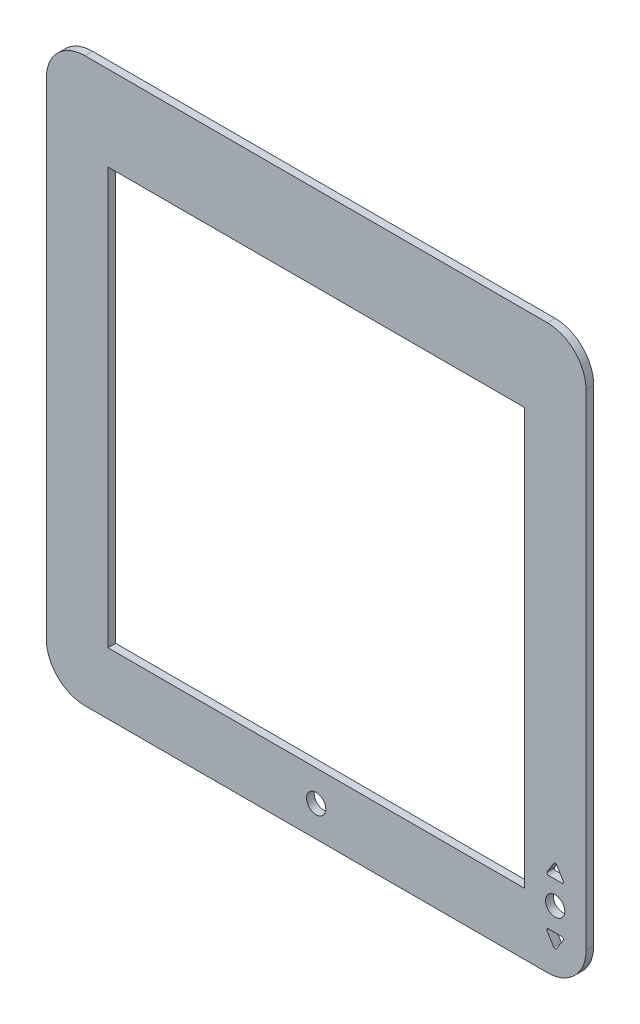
ISO-10303-21;
HEADER;
FILE_DESCRIPTION(('STEP AP214'),'2;1');
FILE_NAME('part.step','',(''),(''),'','','');
FILE_SCHEMA(('AUTOMOTIVE_DESIGN { 1 0 10303 214 1 1 1 1 }'));
ENDSEC;
DATA;
#1=APPLICATION_CONTEXT('core data for automotive mechanical design processes');
#2=APPLICATION_PROTOCOL_DEFINITION('international standard','automotive_design',2000,#1);
#3=PRODUCT_CONTEXT('',#1,'mechanical');
#4=PRODUCT('Part','Part','',(#3));
#5=PRODUCT_RELATED_PRODUCT_CATEGORY('part','',(#4));
#6=PRODUCT_DEFINITION_FORMATION('','',#4);
#7=PRODUCT_DEFINITION_CONTEXT('part definition',#1,'design');
#8=PRODUCT_DEFINITION('design','',#6,#7);
#9=PRODUCT_DEFINITION_SHAPE('','',#8);
#10=(LENGTH_UNIT() NAMED_UNIT(*) SI_UNIT(.MILLI.,.METRE.));
#11=(NAMED_UNIT(*) PLANE_ANGLE_UNIT() SI_UNIT($,.RADIAN.));
#12=(NAMED_UNIT(*) SI_UNIT($,.STERADIAN.) SOLID_ANGLE_UNIT());
#13=UNCERTAINTY_MEASURE_WITH_UNIT(LENGTH_MEASURE(1.E-05),#10,'distance_accuracy_value','');
#14=(GEOMETRIC_REPRESENTATION_CONTEXT(3) GLOBAL_UNCERTAINTY_ASSIGNED_CONTEXT((#13)) GLOBAL_UNIT_ASSIGNED_CONTEXT((#10,
#11,#12)) REPRESENTATION_CONTEXT('',''));
#15=CARTESIAN_POINT('',(0.,0.,0.));
#16=DIRECTION('',(0.,0.,1.));
#17=DIRECTION('',(1.,0.,0.));
#18=AXIS2_PLACEMENT_3D('',#15,#16,#17);
#19=CARTESIAN_POINT('',(0.,0.,10.));
#20=DIRECTION('',(0.,0.,1.));
#21=DIRECTION('',(1.,0.,0.));
#22=AXIS2_PLACEMENT_3D('',#19,#20,#21);
#23=PLANE('',#22);
#24=DIRECTION('',(0.529967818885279,-0.848017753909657,0.));
#25=VECTOR('',#24,1.);
#26=CARTESIAN_POINT('',(297.5,-300.,10.));
#27=LINE('',#26,#25);
#28=CARTESIAN_POINT('',(299.412303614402,-303.05993563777,10.));
#29=VERTEX_POINT('',#28);
#30=CARTESIAN_POINT('',(308.303964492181,-317.287754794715,10.));
#31=VERTEX_POINT('',#30);
#32=EDGE_CURVE('E386',#29,#31,#27,.T.);
#33=ORIENTED_EDGE('',*,*,#32,.F.);
#34=CARTESIAN_POINT('',(301.108339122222,-302.,10.));
#35=DIRECTION('',(0.,0.,1.));
#36=DIRECTION('',(1.,0.,0.));
#37=AXIS2_PLACEMENT_3D('',#34,#35,#36);
#38=CIRCLE('',#37,2.);
#39=CARTESIAN_POINT('',(301.108339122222,-300.,10.));
#40=VERTEX_POINT('',#39);
#41=EDGE_CURVE('E335',#29,#40,#38,.F.);
#42=ORIENTED_EDGE('',*,*,#41,.T.);
#43=DIRECTION('',(-1.,0.,0.));
#44=VECTOR('',#43,1.);
#45=CARTESIAN_POINT('',(297.5,-300.,10.));
#46=LINE('',#45,#44);
#47=CARTESIAN_POINT('',(318.891660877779,-300.,10.));
#48=VERTEX_POINT('',#47);
#49=EDGE_CURVE('E392',#48,#40,#46,.T.);
#50=ORIENTED_EDGE('',*,*,#49,.F.);
#51=CARTESIAN_POINT('',(318.891660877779,-302.,10.));
#52=DIRECTION('',(0.,0.,1.));
#53=DIRECTION('',(1.,0.,0.));
#54=AXIS2_PLACEMENT_3D('',#51,#52,#53);
#55=CIRCLE('',#54,2.);
#56=CARTESIAN_POINT('',(320.587696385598,-303.05993563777,10.));
#57=VERTEX_POINT('',#56);
#58=EDGE_CURVE('E331',#48,#57,#55,.F.);
#59=ORIENTED_EDGE('',*,*,#58,.T.);
#60=DIRECTION('',(0.529967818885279,0.848017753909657,0.));
#61=VECTOR('',#60,1.);
#62=CARTESIAN_POINT('',(310.,-320.001633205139,10.));
#63=LINE('',#62,#61);
#64=CARTESIAN_POINT('',(311.696035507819,-317.287754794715,10.));
#65=VERTEX_POINT('',#64);
#66=EDGE_CURVE('E389',#65,#57,#63,.T.);
#67=ORIENTED_EDGE('',*,*,#66,.F.);
#68=CARTESIAN_POINT('',(310.,-316.227819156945,10.));
#69=DIRECTION('',(0.,0.,1.));
#70=DIRECTION('',(1.,0.,0.));
#71=AXIS2_PLACEMENT_3D('',#68,#69,#70);
#72=CIRCLE('',#71,2.);
#73=EDGE_CURVE('E327',#65,#31,#72,.F.);
#74=ORIENTED_EDGE('',*,*,#73,.T.);
#75=EDGE_LOOP('',(#33,#42,#50,#59,#67,#74));
#76=FACE_BOUND('',#75,.T.);
#77=DIRECTION('',(-0.529919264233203,-0.848048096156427,0.));
#78=VECTOR('',#77,1.);
#79=CARTESIAN_POINT('',(297.5,-240.,10.));
#80=LINE('',#79,#78);
#81=CARTESIAN_POINT('',(308.301645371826,-222.71375394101,10.));
#82=VERTEX_POINT('',#81);
#83=CARTESIAN_POINT('',(299.41199931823,-236.940161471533,10.));
#84=VERTEX_POINT('',#83);
#85=EDGE_CURVE('E349',#82,#84,#80,.T.);
#86=ORIENTED_EDGE('',*,*,#85,.F.);
#87=CARTESIAN_POINT('',(309.997741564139,-223.773592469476,10.));
#88=DIRECTION('',(0.,0.,1.));
#89=DIRECTION('',(1.,0.,0.));
#90=AXIS2_PLACEMENT_3D('',#87,#88,#89);
#91=CIRCLE('',#90,2.);
#92=CARTESIAN_POINT('',(311.693638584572,-222.713435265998,10.));
#93=VERTEX_POINT('',#92);
#94=EDGE_CURVE('E42',#82,#93,#91,.F.);
#95=ORIENTED_EDGE('',*,*,#94,.T.);
#96=DIRECTION('',(-0.53007860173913,0.847948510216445,0.));
#97=VECTOR('',#96,1.);
#98=CARTESIAN_POINT('',(309.997387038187,-220.,10.));
#99=LINE('',#98,#97);
#100=CARTESIAN_POINT('',(320.58700194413,-236.939842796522,10.));
#101=VERTEX_POINT('',#100);
#102=EDGE_CURVE('E348',#101,#93,#99,.T.);
#103=ORIENTED_EDGE('',*,*,#102,.F.);
#104=CARTESIAN_POINT('',(318.891104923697,-238.,10.));
#105=DIRECTION('',(0.,0.,1.));
#106=DIRECTION('',(1.,0.,0.));
#107=AXIS2_PLACEMENT_3D('',#104,#105,#106);
#108=CIRCLE('',#107,2.);
#109=CARTESIAN_POINT('',(318.891104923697,-240.,10.));
#110=VERTEX_POINT('',#109);
#111=EDGE_CURVE('E339',#101,#110,#108,.F.);
#112=ORIENTED_EDGE('',*,*,#111,.T.);
#113=DIRECTION('',(1.,0.,0.));
#114=VECTOR('',#113,1.);
#115=CARTESIAN_POINT('',(297.5,-240.,10.));
#116=LINE('',#115,#114);
#117=CARTESIAN_POINT('',(301.108095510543,-240.,10.));
#118=VERTEX_POINT('',#117);
#119=EDGE_CURVE('E356',#118,#110,#116,.T.);
#120=ORIENTED_EDGE('',*,*,#119,.F.);
#121=CARTESIAN_POINT('',(301.108095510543,-238.,10.));
#122=DIRECTION('',(0.,0.,1.));
#123=DIRECTION('',(1.,0.,0.));
#124=AXIS2_PLACEMENT_3D('',#121,#122,#123);
#125=CIRCLE('',#124,2.);
#126=EDGE_CURVE('E49',#118,#84,#125,.F.);
#127=ORIENTED_EDGE('',*,*,#126,.T.);
#128=EDGE_LOOP('',(#86,#95,#103,#112,#120,#127));
#129=FACE_BOUND('',#128,.T.);
#130=CARTESIAN_POINT('',(310.,-270.,10.));
#131=DIRECTION('',(0.,0.,1.));
#132=DIRECTION('',(1.,0.,0.));
#133=AXIS2_PLACEMENT_3D('',#130,#131,#132);
#134=CIRCLE('',#133,12.5);
#135=CARTESIAN_POINT('',(322.5,-270.,10.));
#136=VERTEX_POINT('',#135);
#137=EDGE_CURVE('E379',#136,#136,#134,.T.);
#138=ORIENTED_EDGE('',*,*,#137,.F.);
#139=EDGE_LOOP('',(#138));
#140=FACE_BOUND('',#139,.T.);
#141=CARTESIAN_POINT('',(0.,-310.,10.));
#142=DIRECTION('',(0.,0.,1.));
#143=DIRECTION('',(1.,0.,0.));
#144=AXIS2_PLACEMENT_3D('',#141,#142,#143);
#145=CIRCLE('',#144,12.5);
#146=CARTESIAN_POINT('',(12.5,-310.,10.));
#147=VERTEX_POINT('',#146);
#148=EDGE_CURVE('E402',#147,#147,#145,.T.);
#149=ORIENTED_EDGE('',*,*,#148,.F.);
#150=EDGE_LOOP('',(#149));
#151=FACE_BOUND('',#150,.T.);
#152=DIRECTION('',(1.,0.,0.));
#153=VECTOR('',#152,1.);
#154=CARTESIAN_POINT('',(350.,-350.,10.));
#155=LINE('',#154,#153);
#156=CARTESIAN_POINT('',(-300.,-350.,10.));
#157=VERTEX_POINT('',#156);
#158=CARTESIAN_POINT('',(300.,-350.,10.));
#159=VERTEX_POINT('',#158);
#160=EDGE_CURVE('E249',#157,#159,#155,.T.);
#161=ORIENTED_EDGE('',*,*,#160,.T.);
#162=CARTESIAN_POINT('',(300.,-300.,10.));
#163=DIRECTION('',(0.,0.,1.));
#164=DIRECTION('',(1.,0.,0.));
#165=AXIS2_PLACEMENT_3D('',#162,#163,#164);
#166=CIRCLE('',#165,50.);
#167=CARTESIAN_POINT('',(350.,-300.,10.));
#168=VERTEX_POINT('',#167);
#169=EDGE_CURVE('E286',#159,#168,#166,.T.);
#170=ORIENTED_EDGE('',*,*,#169,.T.);
#171=DIRECTION('',(0.,1.,0.));
#172=VECTOR('',#171,1.);
#173=CARTESIAN_POINT('',(350.,350.,10.));
#174=LINE('',#173,#172);
#175=CARTESIAN_POINT('',(350.,330.,10.));
#176=VERTEX_POINT('',#175);
#177=EDGE_CURVE('E239',#168,#176,#174,.T.);
#178=ORIENTED_EDGE('',*,*,#177,.T.);
#179=CARTESIAN_POINT('',(300.,330.,10.));
#180=DIRECTION('',(0.,0.,1.));
#181=DIRECTION('',(1.,0.,0.));
#182=AXIS2_PLACEMENT_3D('',#179,#180,#181);
#183=CIRCLE('',#182,50.);
#184=CARTESIAN_POINT('',(300.,380.,10.));
#185=VERTEX_POINT('',#184);
#186=EDGE_CURVE('E280',#176,#185,#183,.T.);
#187=ORIENTED_EDGE('',*,*,#186,.T.);
#188=DIRECTION('',(-1.,0.,0.));
#189=VECTOR('',#188,1.);
#190=CARTESIAN_POINT('',(350.,380.,10.));
#191=LINE('',#190,#189);
#192=CARTESIAN_POINT('',(-300.,380.,10.));
#193=VERTEX_POINT('',#192);
#194=EDGE_CURVE('E242',#185,#193,#191,.T.);
#195=ORIENTED_EDGE('',*,*,#194,.T.);
#196=CARTESIAN_POINT('',(-300.,330.,10.));
#197=DIRECTION('',(0.,0.,1.));
#198=DIRECTION('',(1.,0.,0.));
#199=AXIS2_PLACEMENT_3D('',#196,#197,#198);
#200=CIRCLE('',#199,50.);
#201=CARTESIAN_POINT('',(-350.,330.,10.));
#202=VERTEX_POINT('',#201);
#203=EDGE_CURVE('E282',#193,#202,#200,.T.);
#204=ORIENTED_EDGE('',*,*,#203,.T.);
#205=DIRECTION('',(0.,-1.,0.));
#206=VECTOR('',#205,1.);
#207=CARTESIAN_POINT('',(-350.,350.,10.));
#208=LINE('',#207,#206);
#209=CARTESIAN_POINT('',(-350.000000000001,-300.,10.));
#210=VERTEX_POINT('',#209);
#211=EDGE_CURVE('E246',#202,#210,#208,.T.);
#212=ORIENTED_EDGE('',*,*,#211,.T.);
#213=CARTESIAN_POINT('',(-300.,-300.,10.));
#214=DIRECTION('',(0.,0.,1.));
#215=DIRECTION('',(1.,0.,0.));
#216=AXIS2_PLACEMENT_3D('',#213,#214,#215);
#217=CIRCLE('',#216,50.);
#218=EDGE_CURVE('E284',#210,#157,#217,.T.);
#219=ORIENTED_EDGE('',*,*,#218,.T.);
#220=EDGE_LOOP('',(#161,#170,#178,#187,#195,#204,#212,#219));
#221=FACE_BOUND('',#220,.T.);
#222=DIRECTION('',(1.,0.,0.));
#223=VECTOR('',#222,1.);
#224=CARTESIAN_POINT('',(270.,-270.,10.));
#225=LINE('',#224,#223);
#226=CARTESIAN_POINT('',(-270.,-270.,10.));
#227=VERTEX_POINT('',#226);
#228=CARTESIAN_POINT('',(270.,-270.,10.));
#229=VERTEX_POINT('',#228);
#230=EDGE_CURVE('E206',#227,#229,#225,.T.);
#231=ORIENTED_EDGE('',*,*,#230,.F.);
#232=DIRECTION('',(0.,-1.,0.));
#233=VECTOR('',#232,1.);
#234=CARTESIAN_POINT('',(-270.,-270.,10.));
#235=LINE('',#234,#233);
#236=CARTESIAN_POINT('',(-270.,270.,10.));
#237=VERTEX_POINT('',#236);
#238=EDGE_CURVE('E196',#237,#227,#235,.T.);
#239=ORIENTED_EDGE('',*,*,#238,.F.);
#240=DIRECTION('',(-1.,0.,0.));
#241=VECTOR('',#240,1.);
#242=CARTESIAN_POINT('',(270.,270.,10.));
#243=LINE('',#242,#241);
#244=CARTESIAN_POINT('',(270.,270.,10.));
#245=VERTEX_POINT('',#244);
#246=EDGE_CURVE('E221',#245,#237,#243,.T.);
#247=ORIENTED_EDGE('',*,*,#246,.F.);
#248=DIRECTION('',(0.,1.,0.));
#249=VECTOR('',#248,1.);
#250=CARTESIAN_POINT('',(270.,-270.,10.));
#251=LINE('',#250,#249);
#252=EDGE_CURVE('E219',#229,#245,#251,.T.);
#253=ORIENTED_EDGE('',*,*,#252,.F.);
#254=EDGE_LOOP('',(#231,#239,#247,#253));
#255=FACE_BOUND('',#254,.T.);
#256=ADVANCED_FACE('F34',(#76,#129,#140,#151,#221,#255),#23,.T.);
#257=CARTESIAN_POINT('',(0.,0.,0.));
#258=DIRECTION('',(0.,0.,1.));
#259=DIRECTION('',(1.,0.,0.));
#260=AXIS2_PLACEMENT_3D('',#257,#258,#259);
#261=PLANE('',#260);
#262=DIRECTION('',(1.,0.,0.));
#263=VECTOR('',#262,1.);
#264=CARTESIAN_POINT('',(297.5,-300.,0.));
#265=LINE('',#264,#263);
#266=CARTESIAN_POINT('',(301.108339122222,-300.,0.));
#267=VERTEX_POINT('',#266);
#268=CARTESIAN_POINT('',(318.891660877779,-300.,0.));
#269=VERTEX_POINT('',#268);
#270=EDGE_CURVE('E380',#267,#269,#265,.T.);
#271=ORIENTED_EDGE('',*,*,#270,.F.);
#272=CARTESIAN_POINT('',(301.108339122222,-302.,0.));
#273=DIRECTION('',(0.,0.,1.));
#274=DIRECTION('',(1.,0.,0.));
#275=AXIS2_PLACEMENT_3D('',#272,#273,#274);
#276=CIRCLE('',#275,2.);
#277=CARTESIAN_POINT('',(299.412303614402,-303.05993563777,0.));
#278=VERTEX_POINT('',#277);
#279=EDGE_CURVE('E337',#267,#278,#276,.T.);
#280=ORIENTED_EDGE('',*,*,#279,.T.);
#281=DIRECTION('',(-0.529967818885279,0.848017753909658,0.));
#282=VECTOR('',#281,1.);
#283=CARTESIAN_POINT('',(297.5,-300.,0.));
#284=LINE('',#283,#282);
#285=CARTESIAN_POINT('',(308.303964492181,-317.287754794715,0.));
#286=VERTEX_POINT('',#285);
#287=EDGE_CURVE('E383',#286,#278,#284,.T.);
#288=ORIENTED_EDGE('',*,*,#287,.F.);
#289=CARTESIAN_POINT('',(310.,-316.227819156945,0.));
#290=DIRECTION('',(0.,0.,1.));
#291=DIRECTION('',(1.,0.,0.));
#292=AXIS2_PLACEMENT_3D('',#289,#290,#291);
#293=CIRCLE('',#292,2.);
#294=CARTESIAN_POINT('',(311.696035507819,-317.287754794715,0.));
#295=VERTEX_POINT('',#294);
#296=EDGE_CURVE('E329',#286,#295,#293,.T.);
#297=ORIENTED_EDGE('',*,*,#296,.T.);
#298=DIRECTION('',(-0.529967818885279,-0.848017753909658,0.));
#299=VECTOR('',#298,1.);
#300=CARTESIAN_POINT('',(310.,-320.001633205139,0.));
#301=LINE('',#300,#299);
#302=CARTESIAN_POINT('',(320.587696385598,-303.05993563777,0.));
#303=VERTEX_POINT('',#302);
#304=EDGE_CURVE('E372',#303,#295,#301,.T.);
#305=ORIENTED_EDGE('',*,*,#304,.F.);
#306=CARTESIAN_POINT('',(318.891660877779,-302.,0.));
#307=DIRECTION('',(0.,0.,1.));
#308=DIRECTION('',(1.,0.,0.));
#309=AXIS2_PLACEMENT_3D('',#306,#307,#308);
#310=CIRCLE('',#309,2.);
#311=EDGE_CURVE('E333',#303,#269,#310,.T.);
#312=ORIENTED_EDGE('',*,*,#311,.T.);
#313=EDGE_LOOP('',(#271,#280,#288,#297,#305,#312));
#314=FACE_BOUND('',#313,.T.);
#315=DIRECTION('',(0.530078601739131,-0.847948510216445,0.));
#316=VECTOR('',#315,1.);
#317=CARTESIAN_POINT('',(309.997387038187,-220.,0.));
#318=LINE('',#317,#316);
#319=CARTESIAN_POINT('',(311.693638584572,-222.713435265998,0.));
#320=VERTEX_POINT('',#319);
#321=CARTESIAN_POINT('',(320.58700194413,-236.939842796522,0.));
#322=VERTEX_POINT('',#321);
#323=EDGE_CURVE('E366',#320,#322,#318,.T.);
#324=ORIENTED_EDGE('',*,*,#323,.F.);
#325=CARTESIAN_POINT('',(309.997741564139,-223.773592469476,0.));
#326=DIRECTION('',(0.,0.,1.));
#327=DIRECTION('',(1.,0.,0.));
#328=AXIS2_PLACEMENT_3D('',#325,#326,#327);
#329=CIRCLE('',#328,2.);
#330=CARTESIAN_POINT('',(308.301645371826,-222.71375394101,0.));
#331=VERTEX_POINT('',#330);
#332=EDGE_CURVE('E11',#320,#331,#329,.T.);
#333=ORIENTED_EDGE('',*,*,#332,.T.);
#334=DIRECTION('',(0.529919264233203,0.848048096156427,0.));
#335=VECTOR('',#334,1.);
#336=CARTESIAN_POINT('',(297.5,-240.,0.));
#337=LINE('',#336,#335);
#338=CARTESIAN_POINT('',(299.41199931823,-236.940161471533,0.));
#339=VERTEX_POINT('',#338);
#340=EDGE_CURVE('E364',#339,#331,#337,.T.);
#341=ORIENTED_EDGE('',*,*,#340,.F.);
#342=CARTESIAN_POINT('',(301.108095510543,-238.,0.));
#343=DIRECTION('',(0.,0.,1.));
#344=DIRECTION('',(1.,0.,0.));
#345=AXIS2_PLACEMENT_3D('',#342,#343,#344);
#346=CIRCLE('',#345,2.);
#347=CARTESIAN_POINT('',(301.108095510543,-240.,0.));
#348=VERTEX_POINT('',#347);
#349=EDGE_CURVE('E344',#339,#348,#346,.T.);
#350=ORIENTED_EDGE('',*,*,#349,.T.);
#351=DIRECTION('',(-1.,0.,0.));
#352=VECTOR('',#351,1.);
#353=CARTESIAN_POINT('',(297.5,-240.,0.));
#354=LINE('',#353,#352);
#355=CARTESIAN_POINT('',(318.891104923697,-240.,0.));
#356=VERTEX_POINT('',#355);
#357=EDGE_CURVE('E355',#356,#348,#354,.T.);
#358=ORIENTED_EDGE('',*,*,#357,.F.);
#359=CARTESIAN_POINT('',(318.891104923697,-238.,0.));
#360=DIRECTION('',(0.,0.,1.));
#361=DIRECTION('',(1.,0.,0.));
#362=AXIS2_PLACEMENT_3D('',#359,#360,#361);
#363=CIRCLE('',#362,2.);
#364=EDGE_CURVE('E341',#356,#322,#363,.T.);
#365=ORIENTED_EDGE('',*,*,#364,.T.);
#366=EDGE_LOOP('',(#324,#333,#341,#350,#358,#365));
#367=FACE_BOUND('',#366,.T.);
#368=CARTESIAN_POINT('',(310.,-270.,0.));
#369=DIRECTION('',(0.,0.,1.));
#370=DIRECTION('',(1.,0.,0.));
#371=AXIS2_PLACEMENT_3D('',#368,#369,#370);
#372=CIRCLE('',#371,12.5);
#373=CARTESIAN_POINT('',(322.5,-270.,0.));
#374=VERTEX_POINT('',#373);
#375=EDGE_CURVE('E399',#374,#374,#372,.F.);
#376=ORIENTED_EDGE('',*,*,#375,.F.);
#377=EDGE_LOOP('',(#376));
#378=FACE_BOUND('',#377,.T.);
#379=CARTESIAN_POINT('',(0.,-310.,0.));
#380=DIRECTION('',(0.,0.,1.));
#381=DIRECTION('',(1.,0.,0.));
#382=AXIS2_PLACEMENT_3D('',#379,#380,#381);
#383=CIRCLE('',#382,12.5);
#384=CARTESIAN_POINT('',(12.5,-310.,0.));
#385=VERTEX_POINT('',#384);
#386=EDGE_CURVE('E228',#385,#385,#383,.F.);
#387=ORIENTED_EDGE('',*,*,#386,.F.);
#388=EDGE_LOOP('',(#387));
#389=FACE_BOUND('',#388,.T.);
#390=DIRECTION('',(0.,1.,0.));
#391=VECTOR('',#390,1.);
#392=CARTESIAN_POINT('',(350.,-350.,0.));
#393=LINE('',#392,#391);
#394=CARTESIAN_POINT('',(350.,-300.,0.));
#395=VERTEX_POINT('',#394);
#396=CARTESIAN_POINT('',(350.,330.,0.));
#397=VERTEX_POINT('',#396);
#398=EDGE_CURVE('E243',#395,#397,#393,.T.);
#399=ORIENTED_EDGE('',*,*,#398,.F.);
#400=CARTESIAN_POINT('',(300.,-300.,0.));
#401=DIRECTION('',(0.,0.,1.));
#402=DIRECTION('',(1.,0.,0.));
#403=AXIS2_PLACEMENT_3D('',#400,#401,#402);
#404=CIRCLE('',#403,50.);
#405=CARTESIAN_POINT('',(300.,-350.,0.));
#406=VERTEX_POINT('',#405);
#407=EDGE_CURVE('E273',#395,#406,#404,.F.);
#408=ORIENTED_EDGE('',*,*,#407,.T.);
#409=DIRECTION('',(1.,0.,0.));
#410=VECTOR('',#409,1.);
#411=CARTESIAN_POINT('',(350.,-350.,0.));
#412=LINE('',#411,#410);
#413=CARTESIAN_POINT('',(-300.,-350.,0.));
#414=VERTEX_POINT('',#413);
#415=EDGE_CURVE('E258',#414,#406,#412,.T.);
#416=ORIENTED_EDGE('',*,*,#415,.F.);
#417=CARTESIAN_POINT('',(-300.,-300.,0.));
#418=DIRECTION('',(0.,0.,1.));
#419=DIRECTION('',(1.,0.,0.));
#420=AXIS2_PLACEMENT_3D('',#417,#418,#419);
#421=CIRCLE('',#420,50.);
#422=CARTESIAN_POINT('',(-350.,-300.,0.));
#423=VERTEX_POINT('',#422);
#424=EDGE_CURVE('E271',#414,#423,#421,.F.);
#425=ORIENTED_EDGE('',*,*,#424,.T.);
#426=DIRECTION('',(0.,-1.,0.));
#427=VECTOR('',#426,1.);
#428=CARTESIAN_POINT('',(-350.,-350.,0.));
#429=LINE('',#428,#427);
#430=CARTESIAN_POINT('',(-350.,330.,0.));
#431=VERTEX_POINT('',#430);
#432=EDGE_CURVE('E255',#431,#423,#429,.T.);
#433=ORIENTED_EDGE('',*,*,#432,.F.);
#434=CARTESIAN_POINT('',(-300.,330.,0.));
#435=DIRECTION('',(0.,0.,1.));
#436=DIRECTION('',(1.,0.,0.));
#437=AXIS2_PLACEMENT_3D('',#434,#435,#436);
#438=CIRCLE('',#437,50.);
#439=CARTESIAN_POINT('',(-300.,380.,0.));
#440=VERTEX_POINT('',#439);
#441=EDGE_CURVE('E269',#431,#440,#438,.F.);
#442=ORIENTED_EDGE('',*,*,#441,.T.);
#443=DIRECTION('',(-1.,0.,0.));
#444=VECTOR('',#443,1.);
#445=CARTESIAN_POINT('',(350.,380.,0.));
#446=LINE('',#445,#444);
#447=CARTESIAN_POINT('',(300.,380.,0.));
#448=VERTEX_POINT('',#447);
#449=EDGE_CURVE('E214',#448,#440,#446,.T.);
#450=ORIENTED_EDGE('',*,*,#449,.F.);
#451=CARTESIAN_POINT('',(300.,330.,0.));
#452=DIRECTION('',(0.,0.,1.));
#453=DIRECTION('',(1.,0.,0.));
#454=AXIS2_PLACEMENT_3D('',#451,#452,#453);
#455=CIRCLE('',#454,50.);
#456=EDGE_CURVE('E267',#448,#397,#455,.F.);
#457=ORIENTED_EDGE('',*,*,#456,.T.);
#458=EDGE_LOOP('',(#399,#408,#416,#425,#433,#442,#450,#457));
#459=FACE_BOUND('',#458,.T.);
#460=DIRECTION('',(0.,-1.,0.));
#461=VECTOR('',#460,1.);
#462=CARTESIAN_POINT('',(-270.,-270.,0.));
#463=LINE('',#462,#461);
#464=CARTESIAN_POINT('',(-270.,270.,0.));
#465=VERTEX_POINT('',#464);
#466=CARTESIAN_POINT('',(-270.,-270.,0.));
#467=VERTEX_POINT('',#466);
#468=EDGE_CURVE('E226',#465,#467,#463,.T.);
#469=ORIENTED_EDGE('',*,*,#468,.T.);
#470=DIRECTION('',(1.,0.,0.));
#471=VECTOR('',#470,1.);
#472=CARTESIAN_POINT('',(270.,-270.,0.));
#473=LINE('',#472,#471);
#474=CARTESIAN_POINT('',(270.,-270.,0.));
#475=VERTEX_POINT('',#474);
#476=EDGE_CURVE('E213',#467,#475,#473,.T.);
#477=ORIENTED_EDGE('',*,*,#476,.T.);
#478=DIRECTION('',(0.,1.,0.));
#479=VECTOR('',#478,1.);
#480=CARTESIAN_POINT('',(270.,-270.,0.));
#481=LINE('',#480,#479);
#482=CARTESIAN_POINT('',(270.,270.,0.));
#483=VERTEX_POINT('',#482);
#484=EDGE_CURVE('E230',#475,#483,#481,.T.);
#485=ORIENTED_EDGE('',*,*,#484,.T.);
#486=DIRECTION('',(-1.,0.,0.));
#487=VECTOR('',#486,1.);
#488=CARTESIAN_POINT('',(270.,270.,0.));
#489=LINE('',#488,#487);
#490=EDGE_CURVE('E207',#483,#465,#489,.T.);
#491=ORIENTED_EDGE('',*,*,#490,.T.);
#492=EDGE_LOOP('',(#469,#477,#485,#491));
#493=FACE_BOUND('',#492,.T.);
#494=ADVANCED_FACE('F362',(#314,#367,#378,#389,#459,#493),#261,.F.);
#495=CARTESIAN_POINT('',(350.,380.,10.));
#496=DIRECTION('',(0.,-1.,0.));
#497=DIRECTION('',(1.,0.,0.));
#498=AXIS2_PLACEMENT_3D('',#495,#496,#497);
#499=PLANE('',#498);
#500=ORIENTED_EDGE('',*,*,#449,.T.);
#501=DIRECTION('',(0.,0.,-1.));
#502=VECTOR('',#501,1.);
#503=CARTESIAN_POINT('',(-300.,380.,10.));
#504=LINE('',#503,#502);
#505=EDGE_CURVE('E296',#440,#193,#504,.F.);
#506=ORIENTED_EDGE('',*,*,#505,.T.);
#507=ORIENTED_EDGE('',*,*,#194,.F.);
#508=DIRECTION('',(0.,0.,-1.));
#509=VECTOR('',#508,1.);
#510=CARTESIAN_POINT('',(300.,380.,10.));
#511=LINE('',#510,#509);
#512=EDGE_CURVE('E293',#185,#448,#511,.T.);
#513=ORIENTED_EDGE('',*,*,#512,.T.);
#514=EDGE_LOOP('',(#500,#506,#507,#513));
#515=FACE_BOUND('',#514,.T.);
#516=ADVANCED_FACE('F411',(#515),#499,.F.);
#517=CARTESIAN_POINT('',(-350.,-350.,10.));
#518=DIRECTION('',(1.,0.,0.));
#519=DIRECTION('',(0.,1.,0.));
#520=AXIS2_PLACEMENT_3D('',#517,#518,#519);
#521=PLANE('',#520);
#522=ORIENTED_EDGE('',*,*,#432,.T.);
#523=DIRECTION('',(0.,0.,-1.));
#524=VECTOR('',#523,1.);
#525=CARTESIAN_POINT('',(-350.,-300.,10.));
#526=LINE('',#525,#524);
#527=EDGE_CURVE('E291',#423,#210,#526,.F.);
#528=ORIENTED_EDGE('',*,*,#527,.T.);
#529=ORIENTED_EDGE('',*,*,#211,.F.);
#530=DIRECTION('',(0.,0.,-1.));
#531=VECTOR('',#530,1.);
#532=CARTESIAN_POINT('',(-350.,330.,10.));
#533=LINE('',#532,#531);
#534=EDGE_CURVE('E288',#202,#431,#533,.T.);
#535=ORIENTED_EDGE('',*,*,#534,.T.);
#536=EDGE_LOOP('',(#522,#528,#529,#535));
#537=FACE_BOUND('',#536,.T.);
#538=ADVANCED_FACE('F446',(#537),#521,.F.);
#539=CARTESIAN_POINT('',(350.,-350.,10.));
#540=DIRECTION('',(0.,1.,0.));
#541=DIRECTION('',(0.,0.,1.));
#542=AXIS2_PLACEMENT_3D('',#539,#540,#541);
#543=PLANE('',#542);
#544=ORIENTED_EDGE('',*,*,#415,.T.);
#545=DIRECTION('',(0.,0.,-1.));
#546=VECTOR('',#545,1.);
#547=CARTESIAN_POINT('',(300.,-350.,10.));
#548=LINE('',#547,#546);
#549=EDGE_CURVE('E278',#406,#159,#548,.F.);
#550=ORIENTED_EDGE('',*,*,#549,.T.);
#551=ORIENTED_EDGE('',*,*,#160,.F.);
#552=DIRECTION('',(0.,0.,-1.));
#553=VECTOR('',#552,1.);
#554=CARTESIAN_POINT('',(-300.,-350.,10.));
#555=LINE('',#554,#553);
#556=EDGE_CURVE('E275',#157,#414,#555,.T.);
#557=ORIENTED_EDGE('',*,*,#556,.T.);
#558=EDGE_LOOP('',(#544,#550,#551,#557));
#559=FACE_BOUND('',#558,.T.);
#560=ADVANCED_FACE('F442',(#559),#543,.F.);
#561=CARTESIAN_POINT('',(350.,-350.,10.));
#562=DIRECTION('',(-1.,0.,0.));
#563=DIRECTION('',(0.,0.,1.));
#564=AXIS2_PLACEMENT_3D('',#561,#562,#563);
#565=PLANE('',#564);
#566=ORIENTED_EDGE('',*,*,#177,.F.);
#567=DIRECTION('',(0.,0.,-1.));
#568=VECTOR('',#567,1.);
#569=CARTESIAN_POINT('',(350.,-300.,10.));
#570=LINE('',#569,#568);
#571=EDGE_CURVE('E264',#168,#395,#570,.T.);
#572=ORIENTED_EDGE('',*,*,#571,.T.);
#573=ORIENTED_EDGE('',*,*,#398,.T.);
#574=DIRECTION('',(0.,0.,-1.));
#575=VECTOR('',#574,1.);
#576=CARTESIAN_POINT('',(350.,330.,10.));
#577=LINE('',#576,#575);
#578=EDGE_CURVE('E252',#397,#176,#577,.F.);
#579=ORIENTED_EDGE('',*,*,#578,.T.);
#580=EDGE_LOOP('',(#566,#572,#573,#579));
#581=FACE_BOUND('',#580,.T.);
#582=ADVANCED_FACE('F439',(#581),#565,.F.);
#583=CARTESIAN_POINT('',(-270.,-270.,10.));
#584=DIRECTION('',(1.,0.,0.));
#585=DIRECTION('',(0.,0.,-1.));
#586=AXIS2_PLACEMENT_3D('',#583,#584,#585);
#587=PLANE('',#586);
#588=ORIENTED_EDGE('',*,*,#468,.F.);
#589=DIRECTION('',(0.,0.,-1.));
#590=VECTOR('',#589,1.);
#591=CARTESIAN_POINT('',(-270.,270.,10.));
#592=LINE('',#591,#590);
#593=EDGE_CURVE('E202',#237,#465,#592,.T.);
#594=ORIENTED_EDGE('',*,*,#593,.F.);
#595=ORIENTED_EDGE('',*,*,#238,.T.);
#596=DIRECTION('',(0.,0.,-1.));
#597=VECTOR('',#596,1.);
#598=CARTESIAN_POINT('',(-270.,-270.,10.));
#599=LINE('',#598,#597);
#600=EDGE_CURVE('E199',#227,#467,#599,.T.);
#601=ORIENTED_EDGE('',*,*,#600,.T.);
#602=EDGE_LOOP('',(#588,#594,#595,#601));
#603=FACE_BOUND('',#602,.T.);
#604=ADVANCED_FACE('F198',(#603),#587,.T.);
#605=CARTESIAN_POINT('',(270.,-270.,10.));
#606=DIRECTION('',(0.,1.,0.));
#607=DIRECTION('',(-1.,0.,0.));
#608=AXIS2_PLACEMENT_3D('',#605,#606,#607);
#609=PLANE('',#608);
#610=ORIENTED_EDGE('',*,*,#476,.F.);
#611=ORIENTED_EDGE('',*,*,#600,.F.);
#612=ORIENTED_EDGE('',*,*,#230,.T.);
#613=DIRECTION('',(0.,0.,-1.));
#614=VECTOR('',#613,1.);
#615=CARTESIAN_POINT('',(270.,-270.,10.));
#616=LINE('',#615,#614);
#617=EDGE_CURVE('E215',#229,#475,#616,.T.);
#618=ORIENTED_EDGE('',*,*,#617,.T.);
#619=EDGE_LOOP('',(#610,#611,#612,#618));
#620=FACE_BOUND('',#619,.T.);
#621=ADVANCED_FACE('F210',(#620),#609,.T.);
#622=CARTESIAN_POINT('',(270.,-270.,10.));
#623=DIRECTION('',(-1.,0.,0.));
#624=DIRECTION('',(0.,0.,1.));
#625=AXIS2_PLACEMENT_3D('',#622,#623,#624);
#626=PLANE('',#625);
#627=ORIENTED_EDGE('',*,*,#484,.F.);
#628=ORIENTED_EDGE('',*,*,#617,.F.);
#629=ORIENTED_EDGE('',*,*,#252,.T.);
#630=DIRECTION('',(0.,0.,-1.));
#631=VECTOR('',#630,1.);
#632=CARTESIAN_POINT('',(270.,270.,10.));
#633=LINE('',#632,#631);
#634=EDGE_CURVE('E236',#245,#483,#633,.T.);
#635=ORIENTED_EDGE('',*,*,#634,.T.);
#636=EDGE_LOOP('',(#627,#628,#629,#635));
#637=FACE_BOUND('',#636,.T.);
#638=ADVANCED_FACE('F421',(#637),#626,.T.);
#639=CARTESIAN_POINT('',(270.,270.,10.));
#640=DIRECTION('',(0.,-1.,0.));
#641=DIRECTION('',(1.,0.,0.));
#642=AXIS2_PLACEMENT_3D('',#639,#640,#641);
#643=PLANE('',#642);
#644=ORIENTED_EDGE('',*,*,#490,.F.);
#645=ORIENTED_EDGE('',*,*,#634,.F.);
#646=ORIENTED_EDGE('',*,*,#246,.T.);
#647=ORIENTED_EDGE('',*,*,#593,.T.);
#648=EDGE_LOOP('',(#644,#645,#646,#647));
#649=FACE_BOUND('',#648,.T.);
#650=ADVANCED_FACE('F418',(#649),#643,.T.);
#651=CARTESIAN_POINT('',(300.,-300.,10.));
#652=DIRECTION('',(0.,0.,-1.));
#653=DIRECTION('',(-1.,0.,0.));
#654=AXIS2_PLACEMENT_3D('',#651,#652,#653);
#655=CYLINDRICAL_SURFACE('',#654,50.);
#656=ORIENTED_EDGE('',*,*,#169,.F.);
#657=ORIENTED_EDGE('',*,*,#549,.F.);
#658=ORIENTED_EDGE('',*,*,#407,.F.);
#659=ORIENTED_EDGE('',*,*,#571,.F.);
#660=EDGE_LOOP('',(#656,#657,#658,#659));
#661=FACE_BOUND('',#660,.T.);
#662=ADVANCED_FACE('F428',(#661),#655,.T.);
#663=CARTESIAN_POINT('',(-300.,-300.,10.));
#664=DIRECTION('',(0.,0.,-1.));
#665=DIRECTION('',(-1.,0.,0.));
#666=AXIS2_PLACEMENT_3D('',#663,#664,#665);
#667=CYLINDRICAL_SURFACE('',#666,50.);
#668=ORIENTED_EDGE('',*,*,#218,.F.);
#669=ORIENTED_EDGE('',*,*,#527,.F.);
#670=ORIENTED_EDGE('',*,*,#424,.F.);
#671=ORIENTED_EDGE('',*,*,#556,.F.);
#672=EDGE_LOOP('',(#668,#669,#670,#671));
#673=FACE_BOUND('',#672,.T.);
#674=ADVANCED_FACE('F456',(#673),#667,.T.);
#675=CARTESIAN_POINT('',(-300.,330.,10.));
#676=DIRECTION('',(0.,0.,-1.));
#677=DIRECTION('',(-1.,0.,0.));
#678=AXIS2_PLACEMENT_3D('',#675,#676,#677);
#679=CYLINDRICAL_SURFACE('',#678,50.);
#680=ORIENTED_EDGE('',*,*,#203,.F.);
#681=ORIENTED_EDGE('',*,*,#505,.F.);
#682=ORIENTED_EDGE('',*,*,#441,.F.);
#683=ORIENTED_EDGE('',*,*,#534,.F.);
#684=EDGE_LOOP('',(#680,#681,#682,#683));
#685=FACE_BOUND('',#684,.T.);
#686=ADVANCED_FACE('F460',(#685),#679,.T.);
#687=CARTESIAN_POINT('',(300.,330.,10.));
#688=DIRECTION('',(0.,0.,-1.));
#689=DIRECTION('',(-1.,0.,0.));
#690=AXIS2_PLACEMENT_3D('',#687,#688,#689);
#691=CYLINDRICAL_SURFACE('',#690,50.);
#692=ORIENTED_EDGE('',*,*,#186,.F.);
#693=ORIENTED_EDGE('',*,*,#578,.F.);
#694=ORIENTED_EDGE('',*,*,#456,.F.);
#695=ORIENTED_EDGE('',*,*,#512,.F.);
#696=EDGE_LOOP('',(#692,#693,#694,#695));
#697=FACE_BOUND('',#696,.T.);
#698=ADVANCED_FACE('F464',(#697),#691,.T.);
#699=CARTESIAN_POINT('',(0.,-310.,-0.000999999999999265));
#700=DIRECTION('',(0.,0.,1.));
#701=DIRECTION('',(1.,0.,0.));
#702=AXIS2_PLACEMENT_3D('',#699,#700,#701);
#703=CYLINDRICAL_SURFACE('',#702,12.5);
#704=ORIENTED_EDGE('',*,*,#148,.T.);
#705=EDGE_LOOP('',(#704));
#706=FACE_BOUND('',#705,.T.);
#707=ORIENTED_EDGE('',*,*,#386,.T.);
#708=EDGE_LOOP('',(#707));
#709=FACE_BOUND('',#708,.T.);
#710=ADVANCED_FACE('F407',(#706,#709),#703,.F.);
#711=CARTESIAN_POINT('',(310.,-270.,-0.000999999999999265));
#712=DIRECTION('',(0.,0.,1.));
#713=DIRECTION('',(1.,0.,0.));
#714=AXIS2_PLACEMENT_3D('',#711,#712,#713);
#715=CYLINDRICAL_SURFACE('',#714,12.5);
#716=ORIENTED_EDGE('',*,*,#137,.T.);
#717=EDGE_LOOP('',(#716));
#718=FACE_BOUND('',#717,.T.);
#719=ORIENTED_EDGE('',*,*,#375,.T.);
#720=EDGE_LOOP('',(#719));
#721=FACE_BOUND('',#720,.T.);
#722=ADVANCED_FACE('F511',(#718,#721),#715,.F.);
#723=CARTESIAN_POINT('',(297.5,-240.,-0.000999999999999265));
#724=DIRECTION('',(-0.848048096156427,0.529919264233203,0.));
#725=DIRECTION('',(-0.529919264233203,-0.848048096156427,0.));
#726=AXIS2_PLACEMENT_3D('',#723,#724,#725);
#727=PLANE('',#726);
#728=ORIENTED_EDGE('',*,*,#85,.T.);
#729=DIRECTION('',(0.,0.,1.));
#730=VECTOR('',#729,1.);
#731=CARTESIAN_POINT('',(299.41199931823,-236.940161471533,0.));
#732=LINE('',#731,#730);
#733=EDGE_CURVE('E325',#84,#339,#732,.F.);
#734=ORIENTED_EDGE('',*,*,#733,.T.);
#735=ORIENTED_EDGE('',*,*,#340,.T.);
#736=DIRECTION('',(0.,0.,1.));
#737=VECTOR('',#736,1.);
#738=CARTESIAN_POINT('',(308.301645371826,-222.71375394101,10.));
#739=LINE('',#738,#737);
#740=EDGE_CURVE('E323',#331,#82,#739,.T.);
#741=ORIENTED_EDGE('',*,*,#740,.T.);
#742=EDGE_LOOP('',(#728,#734,#735,#741));
#743=FACE_BOUND('',#742,.T.);
#744=ADVANCED_FACE('F368',(#743),#727,.F.);
#745=CARTESIAN_POINT('',(309.997387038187,-220.,-0.000999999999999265));
#746=DIRECTION('',(0.847948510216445,0.53007860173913,0.));
#747=DIRECTION('',(-0.530078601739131,0.847948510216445,0.));
#748=AXIS2_PLACEMENT_3D('',#745,#746,#747);
#749=PLANE('',#748);
#750=ORIENTED_EDGE('',*,*,#323,.T.);
#751=DIRECTION('',(0.,0.,1.));
#752=VECTOR('',#751,1.);
#753=CARTESIAN_POINT('',(320.58700194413,-236.939842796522,10.));
#754=LINE('',#753,#752);
#755=EDGE_CURVE('E315',#322,#101,#754,.T.);
#756=ORIENTED_EDGE('',*,*,#755,.T.);
#757=ORIENTED_EDGE('',*,*,#102,.T.);
#758=DIRECTION('',(0.,0.,1.));
#759=VECTOR('',#758,1.);
#760=CARTESIAN_POINT('',(311.693638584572,-222.713435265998,0.));
#761=LINE('',#760,#759);
#762=EDGE_CURVE('E313',#93,#320,#761,.F.);
#763=ORIENTED_EDGE('',*,*,#762,.T.);
#764=EDGE_LOOP('',(#750,#756,#757,#763));
#765=FACE_BOUND('',#764,.T.);
#766=ADVANCED_FACE('F352',(#765),#749,.F.);
#767=CARTESIAN_POINT('',(297.5,-240.,-0.000999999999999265));
#768=DIRECTION('',(0.,-1.,0.));
#769=DIRECTION('',(0.,0.,-1.));
#770=AXIS2_PLACEMENT_3D('',#767,#768,#769);
#771=PLANE('',#770);
#772=ORIENTED_EDGE('',*,*,#119,.T.);
#773=DIRECTION('',(0.,0.,1.));
#774=VECTOR('',#773,1.);
#775=CARTESIAN_POINT('',(318.891104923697,-240.,0.));
#776=LINE('',#775,#774);
#777=EDGE_CURVE('E321',#110,#356,#776,.F.);
#778=ORIENTED_EDGE('',*,*,#777,.T.);
#779=ORIENTED_EDGE('',*,*,#357,.T.);
#780=DIRECTION('',(0.,0.,1.));
#781=VECTOR('',#780,1.);
#782=CARTESIAN_POINT('',(301.108095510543,-240.,10.));
#783=LINE('',#782,#781);
#784=EDGE_CURVE('E318',#348,#118,#783,.T.);
#785=ORIENTED_EDGE('',*,*,#784,.T.);
#786=EDGE_LOOP('',(#772,#778,#779,#785));
#787=FACE_BOUND('',#786,.T.);
#788=ADVANCED_FACE('F495',(#787),#771,.F.);
#789=CARTESIAN_POINT('',(297.5,-300.,-0.000999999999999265));
#790=DIRECTION('',(-0.848017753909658,-0.529967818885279,0.));
#791=DIRECTION('',(0.529967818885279,-0.848017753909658,0.));
#792=AXIS2_PLACEMENT_3D('',#789,#790,#791);
#793=PLANE('',#792);
#794=ORIENTED_EDGE('',*,*,#32,.T.);
#795=DIRECTION('',(0.,0.,1.));
#796=VECTOR('',#795,1.);
#797=CARTESIAN_POINT('',(308.303964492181,-317.287754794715,0.));
#798=LINE('',#797,#796);
#799=EDGE_CURVE('E306',#31,#286,#798,.F.);
#800=ORIENTED_EDGE('',*,*,#799,.T.);
#801=ORIENTED_EDGE('',*,*,#287,.T.);
#802=DIRECTION('',(0.,0.,1.));
#803=VECTOR('',#802,1.);
#804=CARTESIAN_POINT('',(299.412303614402,-303.05993563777,10.));
#805=LINE('',#804,#803);
#806=EDGE_CURVE('E303',#278,#29,#805,.T.);
#807=ORIENTED_EDGE('',*,*,#806,.T.);
#808=EDGE_LOOP('',(#794,#800,#801,#807));
#809=FACE_BOUND('',#808,.T.);
#810=ADVANCED_FACE('F498',(#809),#793,.F.);
#811=CARTESIAN_POINT('',(297.5,-300.,-0.000999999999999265));
#812=DIRECTION('',(0.,1.,0.));
#813=DIRECTION('',(0.,0.,1.));
#814=AXIS2_PLACEMENT_3D('',#811,#812,#813);
#815=PLANE('',#814);
#816=ORIENTED_EDGE('',*,*,#270,.T.);
#817=DIRECTION('',(0.,0.,1.));
#818=VECTOR('',#817,1.);
#819=CARTESIAN_POINT('',(318.891660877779,-300.,10.));
#820=LINE('',#819,#818);
#821=EDGE_CURVE('E310',#269,#48,#820,.T.);
#822=ORIENTED_EDGE('',*,*,#821,.T.);
#823=ORIENTED_EDGE('',*,*,#49,.T.);
#824=DIRECTION('',(0.,0.,1.));
#825=VECTOR('',#824,1.);
#826=CARTESIAN_POINT('',(301.108339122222,-300.,0.));
#827=LINE('',#826,#825);
#828=EDGE_CURVE('E308',#40,#267,#827,.F.);
#829=ORIENTED_EDGE('',*,*,#828,.T.);
#830=EDGE_LOOP('',(#816,#822,#823,#829));
#831=FACE_BOUND('',#830,.T.);
#832=ADVANCED_FACE('F504',(#831),#815,.F.);
#833=CARTESIAN_POINT('',(310.,-320.001633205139,-0.000999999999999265));
#834=DIRECTION('',(0.848017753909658,-0.529967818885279,0.));
#835=DIRECTION('',(0.529967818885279,0.848017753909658,0.));
#836=AXIS2_PLACEMENT_3D('',#833,#834,#835);
#837=PLANE('',#836);
#838=ORIENTED_EDGE('',*,*,#304,.T.);
#839=DIRECTION('',(0.,0.,1.));
#840=VECTOR('',#839,1.);
#841=CARTESIAN_POINT('',(311.696035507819,-317.287754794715,10.));
#842=LINE('',#841,#840);
#843=EDGE_CURVE('E300',#295,#65,#842,.T.);
#844=ORIENTED_EDGE('',*,*,#843,.T.);
#845=ORIENTED_EDGE('',*,*,#66,.T.);
#846=DIRECTION('',(0.,0.,1.));
#847=VECTOR('',#846,1.);
#848=CARTESIAN_POINT('',(320.587696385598,-303.05993563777,0.));
#849=LINE('',#848,#847);
#850=EDGE_CURVE('E298',#57,#303,#849,.F.);
#851=ORIENTED_EDGE('',*,*,#850,.T.);
#852=EDGE_LOOP('',(#838,#844,#845,#851));
#853=FACE_BOUND('',#852,.T.);
#854=ADVANCED_FACE('F473',(#853),#837,.F.);
#855=CARTESIAN_POINT('',(310.,-316.227819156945,-0.000999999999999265));
#856=DIRECTION('',(0.,0.,-1.));
#857=DIRECTION('',(-1.,0.,0.));
#858=AXIS2_PLACEMENT_3D('',#855,#856,#857);
#859=CYLINDRICAL_SURFACE('',#858,2.);
#860=ORIENTED_EDGE('',*,*,#296,.F.);
#861=ORIENTED_EDGE('',*,*,#799,.F.);
#862=ORIENTED_EDGE('',*,*,#73,.F.);
#863=ORIENTED_EDGE('',*,*,#843,.F.);
#864=EDGE_LOOP('',(#860,#861,#862,#863));
#865=FACE_BOUND('',#864,.T.);
#866=ADVANCED_FACE('F469',(#865),#859,.F.);
#867=CARTESIAN_POINT('',(318.891660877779,-302.,-0.000999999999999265));
#868=DIRECTION('',(0.,0.,-1.));
#869=DIRECTION('',(-1.,0.,0.));
#870=AXIS2_PLACEMENT_3D('',#867,#868,#869);
#871=CYLINDRICAL_SURFACE('',#870,2.);
#872=ORIENTED_EDGE('',*,*,#311,.F.);
#873=ORIENTED_EDGE('',*,*,#850,.F.);
#874=ORIENTED_EDGE('',*,*,#58,.F.);
#875=ORIENTED_EDGE('',*,*,#821,.F.);
#876=EDGE_LOOP('',(#872,#873,#874,#875));
#877=FACE_BOUND('',#876,.T.);
#878=ADVANCED_FACE('F472',(#877),#871,.F.);
#879=CARTESIAN_POINT('',(301.108339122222,-302.,-0.000999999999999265));
#880=DIRECTION('',(0.,0.,-1.));
#881=DIRECTION('',(-1.,0.,0.));
#882=AXIS2_PLACEMENT_3D('',#879,#880,#881);
#883=CYLINDRICAL_SURFACE('',#882,2.);
#884=ORIENTED_EDGE('',*,*,#279,.F.);
#885=ORIENTED_EDGE('',*,*,#828,.F.);
#886=ORIENTED_EDGE('',*,*,#41,.F.);
#887=ORIENTED_EDGE('',*,*,#806,.F.);
#888=EDGE_LOOP('',(#884,#885,#886,#887));
#889=FACE_BOUND('',#888,.T.);
#890=ADVANCED_FACE('F477',(#889),#883,.F.);
#891=CARTESIAN_POINT('',(318.891104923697,-238.,-0.000999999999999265));
#892=DIRECTION('',(0.,0.,-1.));
#893=DIRECTION('',(-1.,0.,0.));
#894=AXIS2_PLACEMENT_3D('',#891,#892,#893);
#895=CYLINDRICAL_SURFACE('',#894,2.);
#896=ORIENTED_EDGE('',*,*,#364,.F.);
#897=ORIENTED_EDGE('',*,*,#777,.F.);
#898=ORIENTED_EDGE('',*,*,#111,.F.);
#899=ORIENTED_EDGE('',*,*,#755,.F.);
#900=EDGE_LOOP('',(#896,#897,#898,#899));
#901=FACE_BOUND('',#900,.T.);
#902=ADVANCED_FACE('F481',(#901),#895,.F.);
#903=CARTESIAN_POINT('',(301.108095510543,-238.,-0.000999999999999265));
#904=DIRECTION('',(0.,0.,-1.));
#905=DIRECTION('',(-1.,0.,0.));
#906=AXIS2_PLACEMENT_3D('',#903,#904,#905);
#907=CYLINDRICAL_SURFACE('',#906,2.);
#908=ORIENTED_EDGE('',*,*,#349,.F.);
#909=ORIENTED_EDGE('',*,*,#733,.F.);
#910=ORIENTED_EDGE('',*,*,#126,.F.);
#911=ORIENTED_EDGE('',*,*,#784,.F.);
#912=EDGE_LOOP('',(#908,#909,#910,#911));
#913=FACE_BOUND('',#912,.T.);
#914=ADVANCED_FACE('F484',(#913),#907,.F.);
#915=CARTESIAN_POINT('',(309.997741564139,-223.773592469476,-0.000999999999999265));
#916=DIRECTION('',(0.,0.,-1.));
#917=DIRECTION('',(-1.,0.,0.));
#918=AXIS2_PLACEMENT_3D('',#915,#916,#917);
#919=CYLINDRICAL_SURFACE('',#918,2.);
#920=ORIENTED_EDGE('',*,*,#332,.F.);
#921=ORIENTED_EDGE('',*,*,#762,.F.);
#922=ORIENTED_EDGE('',*,*,#94,.F.);
#923=ORIENTED_EDGE('',*,*,#740,.F.);
#924=EDGE_LOOP('',(#920,#921,#922,#923));
#925=FACE_BOUND('',#924,.T.);
#926=ADVANCED_FACE('F36',(#925),#919,.F.);
#927=CLOSED_SHELL('',(#256,#494,#516,#538,#560,#582,#604,#621,#638,#650,#662,#674,#686,#698,
#710,#722,#744,#766,#788,#810,#832,#854,#866,#878,#890,#902,#914,#926));
#928=MANIFOLD_SOLID_BREP('B2',#927);
#929=ADVANCED_BREP_SHAPE_REPRESENTATION('',(#18,#928),#14);
#930=SHAPE_DEFINITION_REPRESENTATION(#9,#929);
ENDSEC;
END-ISO-10303-21;
